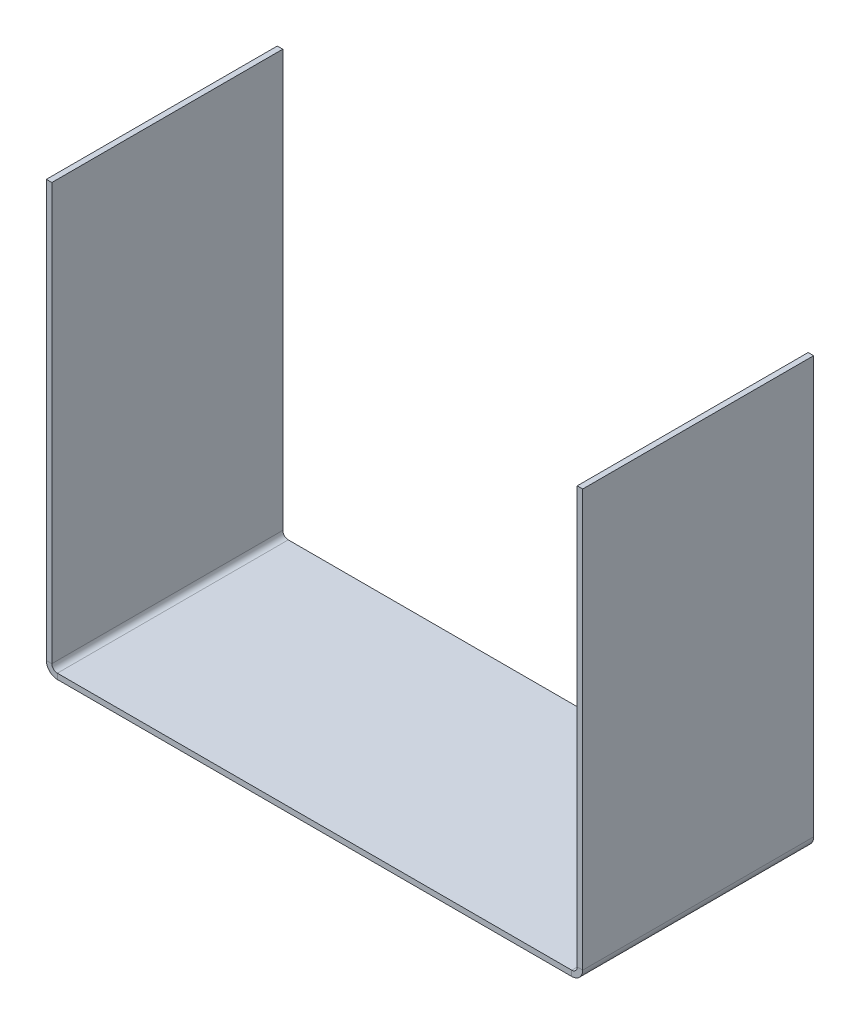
ISO-10303-21;
HEADER;
FILE_DESCRIPTION(('STEP AP214'),'2;1');
FILE_NAME('part.step','',(''),(''),'','','');
FILE_SCHEMA(('AUTOMOTIVE_DESIGN { 1 0 10303 214 1 1 1 1 }'));
ENDSEC;
DATA;
#1=APPLICATION_CONTEXT('core data for automotive mechanical design processes');
#2=APPLICATION_PROTOCOL_DEFINITION('international standard','automotive_design',2000,#1);
#3=PRODUCT_CONTEXT('',#1,'mechanical');
#4=PRODUCT('Part','Part','',(#3));
#5=PRODUCT_RELATED_PRODUCT_CATEGORY('part','',(#4));
#6=PRODUCT_DEFINITION_FORMATION('','',#4);
#7=PRODUCT_DEFINITION_CONTEXT('part definition',#1,'design');
#8=PRODUCT_DEFINITION('design','',#6,#7);
#9=PRODUCT_DEFINITION_SHAPE('','',#8);
#10=(LENGTH_UNIT() NAMED_UNIT(*) SI_UNIT(.MILLI.,.METRE.));
#11=(NAMED_UNIT(*) PLANE_ANGLE_UNIT() SI_UNIT($,.RADIAN.));
#12=(NAMED_UNIT(*) SI_UNIT($,.STERADIAN.) SOLID_ANGLE_UNIT());
#13=UNCERTAINTY_MEASURE_WITH_UNIT(LENGTH_MEASURE(1.E-05),#10,'distance_accuracy_value','');
#14=(GEOMETRIC_REPRESENTATION_CONTEXT(3) GLOBAL_UNCERTAINTY_ASSIGNED_CONTEXT((#13)) GLOBAL_UNIT_ASSIGNED_CONTEXT((#10,
#11,#12)) REPRESENTATION_CONTEXT('',''));
#15=CARTESIAN_POINT('',(0.,0.,0.));
#16=DIRECTION('',(0.,0.,1.));
#17=DIRECTION('',(1.,0.,0.));
#18=AXIS2_PLACEMENT_3D('',#15,#16,#17);
#19=CARTESIAN_POINT('',(70.5274693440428,0.,31.));
#20=DIRECTION('',(0.,0.,1.));
#21=DIRECTION('',(1.,0.,0.));
#22=AXIS2_PLACEMENT_3D('',#19,#20,#21);
#23=PLANE('',#22);
#24=DIRECTION('',(0.,1.,0.));
#25=VECTOR('',#24,1.);
#26=CARTESIAN_POINT('',(70.5274693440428,0.,31.));
#27=LINE('',#26,#25);
#28=CARTESIAN_POINT('',(70.5274693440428,0.,31.));
#29=VERTEX_POINT('',#28);
#30=CARTESIAN_POINT('',(70.5274693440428,0.7366,31.));
#31=VERTEX_POINT('',#30);
#32=EDGE_CURVE('E11',#29,#31,#27,.T.);
#33=ORIENTED_EDGE('',*,*,#32,.F.);
#34=CARTESIAN_POINT('',(70.5274693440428,1.4732,31.));
#35=DIRECTION('',(0.,0.,1.));
#36=DIRECTION('',(1.,0.,0.));
#37=AXIS2_PLACEMENT_3D('',#34,#35,#36);
#38=CIRCLE('',#37,1.4732);
#39=CARTESIAN_POINT('',(72.0006693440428,1.4732,31.));
#40=VERTEX_POINT('',#39);
#41=EDGE_CURVE('E187',#40,#29,#38,.F.);
#42=ORIENTED_EDGE('',*,*,#41,.F.);
#43=DIRECTION('',(1.,0.,0.));
#44=VECTOR('',#43,1.);
#45=CARTESIAN_POINT('',(71.2640693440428,1.4732,31.));
#46=LINE('',#45,#44);
#47=CARTESIAN_POINT('',(71.2640693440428,1.4732,31.));
#48=VERTEX_POINT('',#47);
#49=EDGE_CURVE('E40',#48,#40,#46,.T.);
#50=ORIENTED_EDGE('',*,*,#49,.F.);
#51=CARTESIAN_POINT('',(70.5274693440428,1.4732,31.));
#52=DIRECTION('',(0.,0.,1.));
#53=DIRECTION('',(1.,0.,0.));
#54=AXIS2_PLACEMENT_3D('',#51,#52,#53);
#55=CIRCLE('',#54,0.7366);
#56=EDGE_CURVE('E199',#48,#31,#55,.F.);
#57=ORIENTED_EDGE('',*,*,#56,.T.);
#58=EDGE_LOOP('',(#33,#42,#50,#57));
#59=FACE_BOUND('',#58,.T.);
#60=ADVANCED_FACE('F33',(#59),#23,.T.);
#61=CARTESIAN_POINT('',(71.2640693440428,1.4732,31.));
#62=DIRECTION('',(0.,0.,1.));
#63=DIRECTION('',(1.,0.,0.));
#64=AXIS2_PLACEMENT_3D('',#61,#62,#63);
#65=PLANE('',#64);
#66=DIRECTION('',(-1.,0.,0.));
#67=VECTOR('',#66,1.);
#68=CARTESIAN_POINT('',(0.,0.,31.));
#69=LINE('',#68,#67);
#70=CARTESIAN_POINT('',(1.4732,0.,31.));
#71=VERTEX_POINT('',#70);
#72=EDGE_CURVE('E184',#29,#71,#69,.T.);
#73=ORIENTED_EDGE('',*,*,#72,.F.);
#74=ORIENTED_EDGE('',*,*,#32,.T.);
#75=DIRECTION('',(1.,0.,0.));
#76=VECTOR('',#75,1.);
#77=CARTESIAN_POINT('',(0.,0.7366,31.));
#78=LINE('',#77,#76);
#79=CARTESIAN_POINT('',(1.4732,0.7366,31.));
#80=VERTEX_POINT('',#79);
#81=EDGE_CURVE('E202',#31,#80,#78,.F.);
#82=ORIENTED_EDGE('',*,*,#81,.T.);
#83=DIRECTION('',(0.,-1.,0.));
#84=VECTOR('',#83,1.);
#85=CARTESIAN_POINT('',(1.4732,0.7366,31.));
#86=LINE('',#85,#84);
#87=EDGE_CURVE('E54',#80,#71,#86,.T.);
#88=ORIENTED_EDGE('',*,*,#87,.T.);
#89=EDGE_LOOP('',(#73,#74,#82,#88));
#90=FACE_BOUND('',#89,.T.);
#91=ADVANCED_FACE('F276',(#90),#65,.T.);
#92=CARTESIAN_POINT('',(72.0006693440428,1.4732,0.));
#93=DIRECTION('',(0.,0.,-1.));
#94=DIRECTION('',(-1.,0.,0.));
#95=AXIS2_PLACEMENT_3D('',#92,#93,#94);
#96=PLANE('',#95);
#97=DIRECTION('',(-1.,0.,0.));
#98=VECTOR('',#97,1.);
#99=CARTESIAN_POINT('',(72.0006693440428,1.4732,0.));
#100=LINE('',#99,#98);
#101=CARTESIAN_POINT('',(72.0006693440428,1.4732,0.));
#102=VERTEX_POINT('',#101);
#103=CARTESIAN_POINT('',(71.2640693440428,1.4732,0.));
#104=VERTEX_POINT('',#103);
#105=EDGE_CURVE('E240',#102,#104,#100,.T.);
#106=ORIENTED_EDGE('',*,*,#105,.F.);
#107=CARTESIAN_POINT('',(70.5274693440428,1.4732,0.));
#108=DIRECTION('',(0.,0.,1.));
#109=DIRECTION('',(1.,0.,0.));
#110=AXIS2_PLACEMENT_3D('',#107,#108,#109);
#111=CIRCLE('',#110,1.4732);
#112=CARTESIAN_POINT('',(70.5274693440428,0.,0.));
#113=VERTEX_POINT('',#112);
#114=EDGE_CURVE('E154',#102,#113,#111,.F.);
#115=ORIENTED_EDGE('',*,*,#114,.T.);
#116=DIRECTION('',(0.,-1.,0.));
#117=VECTOR('',#116,1.);
#118=CARTESIAN_POINT('',(70.5274693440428,0.7366,0.));
#119=LINE('',#118,#117);
#120=CARTESIAN_POINT('',(70.5274693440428,0.7366,0.));
#121=VERTEX_POINT('',#120);
#122=EDGE_CURVE('E238',#121,#113,#119,.T.);
#123=ORIENTED_EDGE('',*,*,#122,.F.);
#124=CARTESIAN_POINT('',(70.5274693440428,1.4732,0.));
#125=DIRECTION('',(0.,0.,1.));
#126=DIRECTION('',(1.,0.,0.));
#127=AXIS2_PLACEMENT_3D('',#124,#125,#126);
#128=CIRCLE('',#127,0.7366);
#129=EDGE_CURVE('E166',#104,#121,#128,.F.);
#130=ORIENTED_EDGE('',*,*,#129,.F.);
#131=EDGE_LOOP('',(#106,#115,#123,#130));
#132=FACE_BOUND('',#131,.T.);
#133=ADVANCED_FACE('F284',(#132),#96,.T.);
#134=CARTESIAN_POINT('',(70.5274693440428,0.7366,0.));
#135=DIRECTION('',(0.,0.,-1.));
#136=DIRECTION('',(-1.,0.,0.));
#137=AXIS2_PLACEMENT_3D('',#134,#135,#136);
#138=PLANE('',#137);
#139=DIRECTION('',(0.,-1.,0.));
#140=VECTOR('',#139,1.);
#141=CARTESIAN_POINT('',(72.0006693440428,0.,0.));
#142=LINE('',#141,#140);
#143=CARTESIAN_POINT('',(72.0006693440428,57.4135207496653,0.));
#144=VERTEX_POINT('',#143);
#145=EDGE_CURVE('E157',#144,#102,#142,.T.);
#146=ORIENTED_EDGE('',*,*,#145,.T.);
#147=ORIENTED_EDGE('',*,*,#105,.T.);
#148=DIRECTION('',(0.,1.,0.));
#149=VECTOR('',#148,1.);
#150=CARTESIAN_POINT('',(71.2640693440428,0.,0.));
#151=LINE('',#150,#149);
#152=CARTESIAN_POINT('',(71.2640693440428,57.4135207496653,0.));
#153=VERTEX_POINT('',#152);
#154=EDGE_CURVE('E163',#153,#104,#151,.F.);
#155=ORIENTED_EDGE('',*,*,#154,.F.);
#156=DIRECTION('',(1.,0.,0.));
#157=VECTOR('',#156,1.);
#158=CARTESIAN_POINT('',(71.2640693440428,57.4135207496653,0.));
#159=LINE('',#158,#157);
#160=EDGE_CURVE('E160',#153,#144,#159,.T.);
#161=ORIENTED_EDGE('',*,*,#160,.T.);
#162=EDGE_LOOP('',(#146,#147,#155,#161));
#163=FACE_BOUND('',#162,.T.);
#164=ADVANCED_FACE('F286',(#163),#138,.T.);
#165=CARTESIAN_POINT('',(0.,1.4732,31.));
#166=DIRECTION('',(0.,0.,1.));
#167=DIRECTION('',(1.,0.,0.));
#168=AXIS2_PLACEMENT_3D('',#165,#166,#167);
#169=PLANE('',#168);
#170=DIRECTION('',(1.,0.,0.));
#171=VECTOR('',#170,1.);
#172=CARTESIAN_POINT('',(0.,1.4732,31.));
#173=LINE('',#172,#171);
#174=CARTESIAN_POINT('',(0.,1.4732,31.));
#175=VERTEX_POINT('',#174);
#176=CARTESIAN_POINT('',(0.7366,1.4732,31.));
#177=VERTEX_POINT('',#176);
#178=EDGE_CURVE('E47',#175,#177,#173,.T.);
#179=ORIENTED_EDGE('',*,*,#178,.F.);
#180=CARTESIAN_POINT('',(1.4732,1.4732,31.));
#181=DIRECTION('',(0.,0.,1.));
#182=DIRECTION('',(1.,0.,0.));
#183=AXIS2_PLACEMENT_3D('',#180,#181,#182);
#184=CIRCLE('',#183,1.4732);
#185=EDGE_CURVE('E181',#71,#175,#184,.F.);
#186=ORIENTED_EDGE('',*,*,#185,.F.);
#187=ORIENTED_EDGE('',*,*,#87,.F.);
#188=CARTESIAN_POINT('',(1.4732,1.4732,31.));
#189=DIRECTION('',(0.,0.,1.));
#190=DIRECTION('',(1.,0.,0.));
#191=AXIS2_PLACEMENT_3D('',#188,#189,#190);
#192=CIRCLE('',#191,0.7366);
#193=EDGE_CURVE('E204',#80,#177,#192,.F.);
#194=ORIENTED_EDGE('',*,*,#193,.T.);
#195=EDGE_LOOP('',(#179,#186,#187,#194));
#196=FACE_BOUND('',#195,.T.);
#197=ADVANCED_FACE('F288',(#196),#169,.T.);
#198=CARTESIAN_POINT('',(1.4732,0.7366,31.));
#199=DIRECTION('',(0.,0.,1.));
#200=DIRECTION('',(1.,0.,0.));
#201=AXIS2_PLACEMENT_3D('',#198,#199,#200);
#202=PLANE('',#201);
#203=DIRECTION('',(0.,1.,0.));
#204=VECTOR('',#203,1.);
#205=CARTESIAN_POINT('',(0.,0.,31.));
#206=LINE('',#205,#204);
#207=CARTESIAN_POINT('',(0.,57.4135207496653,31.));
#208=VERTEX_POINT('',#207);
#209=EDGE_CURVE('E178',#175,#208,#206,.T.);
#210=ORIENTED_EDGE('',*,*,#209,.F.);
#211=ORIENTED_EDGE('',*,*,#178,.T.);
#212=DIRECTION('',(0.,1.,0.));
#213=VECTOR('',#212,1.);
#214=CARTESIAN_POINT('',(0.7366,0.,31.));
#215=LINE('',#214,#213);
#216=CARTESIAN_POINT('',(0.7366,57.4135207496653,31.));
#217=VERTEX_POINT('',#216);
#218=EDGE_CURVE('E175',#177,#217,#215,.T.);
#219=ORIENTED_EDGE('',*,*,#218,.T.);
#220=DIRECTION('',(1.,0.,0.));
#221=VECTOR('',#220,1.);
#222=CARTESIAN_POINT('',(0.,57.4135207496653,31.));
#223=LINE('',#222,#221);
#224=EDGE_CURVE('E128',#208,#217,#223,.T.);
#225=ORIENTED_EDGE('',*,*,#224,.F.);
#226=EDGE_LOOP('',(#210,#211,#219,#225));
#227=FACE_BOUND('',#226,.T.);
#228=ADVANCED_FACE('F294',(#227),#202,.T.);
#229=CARTESIAN_POINT('',(1.4732,0.,0.));
#230=DIRECTION('',(0.,0.,-1.));
#231=DIRECTION('',(-1.,0.,0.));
#232=AXIS2_PLACEMENT_3D('',#229,#230,#231);
#233=PLANE('',#232);
#234=DIRECTION('',(0.,1.,0.));
#235=VECTOR('',#234,1.);
#236=CARTESIAN_POINT('',(1.4732,0.,0.));
#237=LINE('',#236,#235);
#238=CARTESIAN_POINT('',(1.4732,0.,0.));
#239=VERTEX_POINT('',#238);
#240=CARTESIAN_POINT('',(1.4732,0.7366,0.));
#241=VERTEX_POINT('',#240);
#242=EDGE_CURVE('E234',#239,#241,#237,.T.);
#243=ORIENTED_EDGE('',*,*,#242,.F.);
#244=CARTESIAN_POINT('',(1.4732,1.4732,0.));
#245=DIRECTION('',(0.,0.,1.));
#246=DIRECTION('',(1.,0.,0.));
#247=AXIS2_PLACEMENT_3D('',#244,#245,#246);
#248=CIRCLE('',#247,1.4732);
#249=CARTESIAN_POINT('',(0.,1.4732,0.));
#250=VERTEX_POINT('',#249);
#251=EDGE_CURVE('E146',#239,#250,#248,.F.);
#252=ORIENTED_EDGE('',*,*,#251,.T.);
#253=DIRECTION('',(-1.,0.,0.));
#254=VECTOR('',#253,1.);
#255=CARTESIAN_POINT('',(0.7366,1.4732,0.));
#256=LINE('',#255,#254);
#257=CARTESIAN_POINT('',(0.7366,1.4732,0.));
#258=VERTEX_POINT('',#257);
#259=EDGE_CURVE('E131',#258,#250,#256,.T.);
#260=ORIENTED_EDGE('',*,*,#259,.F.);
#261=CARTESIAN_POINT('',(1.4732,1.4732,0.));
#262=DIRECTION('',(0.,0.,1.));
#263=DIRECTION('',(1.,0.,0.));
#264=AXIS2_PLACEMENT_3D('',#261,#262,#263);
#265=CIRCLE('',#264,0.7366);
#266=EDGE_CURVE('E172',#241,#258,#265,.F.);
#267=ORIENTED_EDGE('',*,*,#266,.F.);
#268=EDGE_LOOP('',(#243,#252,#260,#267));
#269=FACE_BOUND('',#268,.T.);
#270=ADVANCED_FACE('F329',(#269),#233,.T.);
#271=CARTESIAN_POINT('',(0.7366,1.4732,0.));
#272=DIRECTION('',(0.,0.,-1.));
#273=DIRECTION('',(-1.,0.,0.));
#274=AXIS2_PLACEMENT_3D('',#271,#272,#273);
#275=PLANE('',#274);
#276=DIRECTION('',(-1.,0.,0.));
#277=VECTOR('',#276,1.);
#278=CARTESIAN_POINT('',(0.,0.,0.));
#279=LINE('',#278,#277);
#280=EDGE_CURVE('E151',#113,#239,#279,.T.);
#281=ORIENTED_EDGE('',*,*,#280,.T.);
#282=ORIENTED_EDGE('',*,*,#242,.T.);
#283=DIRECTION('',(1.,0.,0.));
#284=VECTOR('',#283,1.);
#285=CARTESIAN_POINT('',(0.,0.7366,0.));
#286=LINE('',#285,#284);
#287=EDGE_CURVE('E169',#121,#241,#286,.F.);
#288=ORIENTED_EDGE('',*,*,#287,.F.);
#289=ORIENTED_EDGE('',*,*,#122,.T.);
#290=EDGE_LOOP('',(#281,#282,#288,#289));
#291=FACE_BOUND('',#290,.T.);
#292=ADVANCED_FACE('F339',(#291),#275,.T.);
#293=CARTESIAN_POINT('',(0.7366,0.,31.));
#294=DIRECTION('',(-1.,0.,0.));
#295=DIRECTION('',(0.,0.,1.));
#296=AXIS2_PLACEMENT_3D('',#293,#294,#295);
#297=PLANE('',#296);
#298=DIRECTION('',(0.,1.,0.));
#299=VECTOR('',#298,1.);
#300=CARTESIAN_POINT('',(0.7366,0.,0.));
#301=LINE('',#300,#299);
#302=CARTESIAN_POINT('',(0.7366,57.4135207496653,0.));
#303=VERTEX_POINT('',#302);
#304=EDGE_CURVE('E136',#258,#303,#301,.T.);
#305=ORIENTED_EDGE('',*,*,#304,.T.);
#306=DIRECTION('',(0.,0.,-1.));
#307=VECTOR('',#306,1.);
#308=CARTESIAN_POINT('',(0.7366,57.4135207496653,31.));
#309=LINE('',#308,#307);
#310=EDGE_CURVE('E121',#217,#303,#309,.T.);
#311=ORIENTED_EDGE('',*,*,#310,.F.);
#312=ORIENTED_EDGE('',*,*,#218,.F.);
#313=DIRECTION('',(0.,0.,-1.));
#314=VECTOR('',#313,1.);
#315=CARTESIAN_POINT('',(0.7366,1.4732,31.));
#316=LINE('',#315,#314);
#317=EDGE_CURVE('E139',#177,#258,#316,.T.);
#318=ORIENTED_EDGE('',*,*,#317,.T.);
#319=EDGE_LOOP('',(#305,#311,#312,#318));
#320=FACE_BOUND('',#319,.T.);
#321=ADVANCED_FACE('F137',(#320),#297,.F.);
#322=CARTESIAN_POINT('',(0.,57.4135207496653,31.));
#323=DIRECTION('',(0.,1.,0.));
#324=DIRECTION('',(0.,0.,1.));
#325=AXIS2_PLACEMENT_3D('',#322,#323,#324);
#326=PLANE('',#325);
#327=DIRECTION('',(1.,0.,0.));
#328=VECTOR('',#327,1.);
#329=CARTESIAN_POINT('',(0.,57.4135207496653,0.));
#330=LINE('',#329,#328);
#331=CARTESIAN_POINT('',(0.,57.4135207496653,0.));
#332=VERTEX_POINT('',#331);
#333=EDGE_CURVE('E125',#332,#303,#330,.T.);
#334=ORIENTED_EDGE('',*,*,#333,.F.);
#335=DIRECTION('',(0.,0.,-1.));
#336=VECTOR('',#335,1.);
#337=CARTESIAN_POINT('',(0.,57.4135207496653,31.));
#338=LINE('',#337,#336);
#339=EDGE_CURVE('E132',#208,#332,#338,.T.);
#340=ORIENTED_EDGE('',*,*,#339,.F.);
#341=ORIENTED_EDGE('',*,*,#224,.T.);
#342=ORIENTED_EDGE('',*,*,#310,.T.);
#343=EDGE_LOOP('',(#334,#340,#341,#342));
#344=FACE_BOUND('',#343,.T.);
#345=ADVANCED_FACE('F123',(#344),#326,.T.);
#346=CARTESIAN_POINT('',(0.,0.,31.));
#347=DIRECTION('',(-1.,0.,0.));
#348=DIRECTION('',(0.,0.,1.));
#349=AXIS2_PLACEMENT_3D('',#346,#347,#348);
#350=PLANE('',#349);
#351=DIRECTION('',(0.,1.,0.));
#352=VECTOR('',#351,1.);
#353=CARTESIAN_POINT('',(0.,0.,0.));
#354=LINE('',#353,#352);
#355=EDGE_CURVE('E144',#250,#332,#354,.T.);
#356=ORIENTED_EDGE('',*,*,#355,.F.);
#357=DIRECTION('',(0.,0.,-1.));
#358=VECTOR('',#357,1.);
#359=CARTESIAN_POINT('',(0.,1.4732,31.));
#360=LINE('',#359,#358);
#361=EDGE_CURVE('E229',#175,#250,#360,.T.);
#362=ORIENTED_EDGE('',*,*,#361,.F.);
#363=ORIENTED_EDGE('',*,*,#209,.T.);
#364=ORIENTED_EDGE('',*,*,#339,.T.);
#365=EDGE_LOOP('',(#356,#362,#363,#364));
#366=FACE_BOUND('',#365,.T.);
#367=ADVANCED_FACE('F368',(#366),#350,.T.);
#368=CARTESIAN_POINT('',(1.4732,1.4732,31.));
#369=DIRECTION('',(0.,0.,-1.));
#370=DIRECTION('',(-1.,0.,0.));
#371=AXIS2_PLACEMENT_3D('',#368,#369,#370);
#372=CYLINDRICAL_SURFACE('',#371,1.4732);
#373=ORIENTED_EDGE('',*,*,#251,.F.);
#374=DIRECTION('',(0.,0.,-1.));
#375=VECTOR('',#374,1.);
#376=CARTESIAN_POINT('',(1.4732,0.,31.));
#377=LINE('',#376,#375);
#378=EDGE_CURVE('E226',#71,#239,#377,.T.);
#379=ORIENTED_EDGE('',*,*,#378,.F.);
#380=ORIENTED_EDGE('',*,*,#185,.T.);
#381=ORIENTED_EDGE('',*,*,#361,.T.);
#382=EDGE_LOOP('',(#373,#379,#380,#381));
#383=FACE_BOUND('',#382,.T.);
#384=ADVANCED_FACE('F378',(#383),#372,.T.);
#385=CARTESIAN_POINT('',(0.,0.,31.));
#386=DIRECTION('',(0.,-1.,0.));
#387=DIRECTION('',(0.,0.,-1.));
#388=AXIS2_PLACEMENT_3D('',#385,#386,#387);
#389=PLANE('',#388);
#390=ORIENTED_EDGE('',*,*,#280,.F.);
#391=DIRECTION('',(0.,0.,-1.));
#392=VECTOR('',#391,1.);
#393=CARTESIAN_POINT('',(70.5274693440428,0.,31.));
#394=LINE('',#393,#392);
#395=EDGE_CURVE('E223',#29,#113,#394,.T.);
#396=ORIENTED_EDGE('',*,*,#395,.F.);
#397=ORIENTED_EDGE('',*,*,#72,.T.);
#398=ORIENTED_EDGE('',*,*,#378,.T.);
#399=EDGE_LOOP('',(#390,#396,#397,#398));
#400=FACE_BOUND('',#399,.T.);
#401=ADVANCED_FACE('F280',(#400),#389,.T.);
#402=CARTESIAN_POINT('',(70.5274693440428,1.4732,31.));
#403=DIRECTION('',(0.,0.,-1.));
#404=DIRECTION('',(-1.,0.,0.));
#405=AXIS2_PLACEMENT_3D('',#402,#403,#404);
#406=CYLINDRICAL_SURFACE('',#405,1.4732);
#407=ORIENTED_EDGE('',*,*,#114,.F.);
#408=DIRECTION('',(0.,0.,-1.));
#409=VECTOR('',#408,1.);
#410=CARTESIAN_POINT('',(72.0006693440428,1.4732,31.));
#411=LINE('',#410,#409);
#412=EDGE_CURVE('E220',#40,#102,#411,.T.);
#413=ORIENTED_EDGE('',*,*,#412,.F.);
#414=ORIENTED_EDGE('',*,*,#41,.T.);
#415=ORIENTED_EDGE('',*,*,#395,.T.);
#416=EDGE_LOOP('',(#407,#413,#414,#415));
#417=FACE_BOUND('',#416,.T.);
#418=ADVANCED_FACE('F252',(#417),#406,.T.);
#419=CARTESIAN_POINT('',(72.0006693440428,0.,31.));
#420=DIRECTION('',(1.,0.,0.));
#421=DIRECTION('',(0.,0.,-1.));
#422=AXIS2_PLACEMENT_3D('',#419,#420,#421);
#423=PLANE('',#422);
#424=ORIENTED_EDGE('',*,*,#145,.F.);
#425=DIRECTION('',(0.,0.,-1.));
#426=VECTOR('',#425,1.);
#427=CARTESIAN_POINT('',(72.0006693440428,57.4135207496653,31.));
#428=LINE('',#427,#426);
#429=CARTESIAN_POINT('',(72.0006693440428,57.4135207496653,31.));
#430=VERTEX_POINT('',#429);
#431=EDGE_CURVE('E218',#430,#144,#428,.T.);
#432=ORIENTED_EDGE('',*,*,#431,.F.);
#433=DIRECTION('',(0.,-1.,0.));
#434=VECTOR('',#433,1.);
#435=CARTESIAN_POINT('',(72.0006693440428,0.,31.));
#436=LINE('',#435,#434);
#437=EDGE_CURVE('E190',#430,#40,#436,.T.);
#438=ORIENTED_EDGE('',*,*,#437,.T.);
#439=ORIENTED_EDGE('',*,*,#412,.T.);
#440=EDGE_LOOP('',(#424,#432,#438,#439));
#441=FACE_BOUND('',#440,.T.);
#442=ADVANCED_FACE('F256',(#441),#423,.T.);
#443=CARTESIAN_POINT('',(71.2640693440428,57.4135207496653,31.));
#444=DIRECTION('',(0.,1.,0.));
#445=DIRECTION('',(0.,0.,1.));
#446=AXIS2_PLACEMENT_3D('',#443,#444,#445);
#447=PLANE('',#446);
#448=ORIENTED_EDGE('',*,*,#160,.F.);
#449=DIRECTION('',(0.,0.,-1.));
#450=VECTOR('',#449,1.);
#451=CARTESIAN_POINT('',(71.2640693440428,57.4135207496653,31.));
#452=LINE('',#451,#450);
#453=CARTESIAN_POINT('',(71.2640693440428,57.4135207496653,31.));
#454=VERTEX_POINT('',#453);
#455=EDGE_CURVE('E216',#454,#153,#452,.T.);
#456=ORIENTED_EDGE('',*,*,#455,.F.);
#457=DIRECTION('',(1.,0.,0.));
#458=VECTOR('',#457,1.);
#459=CARTESIAN_POINT('',(71.2640693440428,57.4135207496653,31.));
#460=LINE('',#459,#458);
#461=EDGE_CURVE('E193',#454,#430,#460,.T.);
#462=ORIENTED_EDGE('',*,*,#461,.T.);
#463=ORIENTED_EDGE('',*,*,#431,.T.);
#464=EDGE_LOOP('',(#448,#456,#462,#463));
#465=FACE_BOUND('',#464,.T.);
#466=ADVANCED_FACE('F259',(#465),#447,.T.);
#467=CARTESIAN_POINT('',(71.2640693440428,0.,31.));
#468=DIRECTION('',(1.,0.,0.));
#469=DIRECTION('',(0.,0.,-1.));
#470=AXIS2_PLACEMENT_3D('',#467,#468,#469);
#471=PLANE('',#470);
#472=ORIENTED_EDGE('',*,*,#154,.T.);
#473=DIRECTION('',(0.,0.,-1.));
#474=VECTOR('',#473,1.);
#475=CARTESIAN_POINT('',(71.2640693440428,1.4732,31.));
#476=LINE('',#475,#474);
#477=EDGE_CURVE('E213',#48,#104,#476,.T.);
#478=ORIENTED_EDGE('',*,*,#477,.F.);
#479=DIRECTION('',(0.,1.,0.));
#480=VECTOR('',#479,1.);
#481=CARTESIAN_POINT('',(71.2640693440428,0.,31.));
#482=LINE('',#481,#480);
#483=EDGE_CURVE('E196',#454,#48,#482,.F.);
#484=ORIENTED_EDGE('',*,*,#483,.F.);
#485=ORIENTED_EDGE('',*,*,#455,.T.);
#486=EDGE_LOOP('',(#472,#478,#484,#485));
#487=FACE_BOUND('',#486,.T.);
#488=ADVANCED_FACE('F262',(#487),#471,.F.);
#489=CARTESIAN_POINT('',(70.5274693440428,1.4732,31.));
#490=DIRECTION('',(0.,0.,-1.));
#491=DIRECTION('',(-1.,0.,0.));
#492=AXIS2_PLACEMENT_3D('',#489,#490,#491);
#493=CYLINDRICAL_SURFACE('',#492,0.7366);
#494=ORIENTED_EDGE('',*,*,#129,.T.);
#495=DIRECTION('',(0.,0.,-1.));
#496=VECTOR('',#495,1.);
#497=CARTESIAN_POINT('',(70.5274693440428,0.7366,31.));
#498=LINE('',#497,#496);
#499=EDGE_CURVE('E210',#31,#121,#498,.T.);
#500=ORIENTED_EDGE('',*,*,#499,.F.);
#501=ORIENTED_EDGE('',*,*,#56,.F.);
#502=ORIENTED_EDGE('',*,*,#477,.T.);
#503=EDGE_LOOP('',(#494,#500,#501,#502));
#504=FACE_BOUND('',#503,.T.);
#505=ADVANCED_FACE('F267',(#504),#493,.F.);
#506=CARTESIAN_POINT('',(0.,0.7366,31.));
#507=DIRECTION('',(0.,-1.,0.));
#508=DIRECTION('',(0.,0.,-1.));
#509=AXIS2_PLACEMENT_3D('',#506,#507,#508);
#510=PLANE('',#509);
#511=ORIENTED_EDGE('',*,*,#287,.T.);
#512=DIRECTION('',(0.,0.,-1.));
#513=VECTOR('',#512,1.);
#514=CARTESIAN_POINT('',(1.4732,0.7366,31.));
#515=LINE('',#514,#513);
#516=EDGE_CURVE('E207',#80,#241,#515,.T.);
#517=ORIENTED_EDGE('',*,*,#516,.F.);
#518=ORIENTED_EDGE('',*,*,#81,.F.);
#519=ORIENTED_EDGE('',*,*,#499,.T.);
#520=EDGE_LOOP('',(#511,#517,#518,#519));
#521=FACE_BOUND('',#520,.T.);
#522=ADVANCED_FACE('F272',(#521),#510,.F.);
#523=CARTESIAN_POINT('',(1.4732,1.4732,31.));
#524=DIRECTION('',(0.,0.,-1.));
#525=DIRECTION('',(-1.,0.,0.));
#526=AXIS2_PLACEMENT_3D('',#523,#524,#525);
#527=CYLINDRICAL_SURFACE('',#526,0.7366);
#528=ORIENTED_EDGE('',*,*,#266,.T.);
#529=ORIENTED_EDGE('',*,*,#317,.F.);
#530=ORIENTED_EDGE('',*,*,#193,.F.);
#531=ORIENTED_EDGE('',*,*,#516,.T.);
#532=EDGE_LOOP('',(#528,#529,#530,#531));
#533=FACE_BOUND('',#532,.T.);
#534=ADVANCED_FACE('F453',(#533),#527,.F.);
#535=CARTESIAN_POINT('',(1.4732,1.4732,31.));
#536=DIRECTION('',(0.,0.,1.));
#537=DIRECTION('',(1.,0.,0.));
#538=AXIS2_PLACEMENT_3D('',#535,#536,#537);
#539=PLANE('',#538);
#540=ORIENTED_EDGE('',*,*,#483,.T.);
#541=ORIENTED_EDGE('',*,*,#49,.T.);
#542=ORIENTED_EDGE('',*,*,#437,.F.);
#543=ORIENTED_EDGE('',*,*,#461,.F.);
#544=EDGE_LOOP('',(#540,#541,#542,#543));
#545=FACE_BOUND('',#544,.T.);
#546=ADVANCED_FACE('F244',(#545),#539,.T.);
#547=CARTESIAN_POINT('',(1.4732,1.4732,0.));
#548=DIRECTION('',(0.,0.,1.));
#549=DIRECTION('',(1.,0.,0.));
#550=AXIS2_PLACEMENT_3D('',#547,#548,#549);
#551=PLANE('',#550);
#552=ORIENTED_EDGE('',*,*,#304,.F.);
#553=ORIENTED_EDGE('',*,*,#259,.T.);
#554=ORIENTED_EDGE('',*,*,#355,.T.);
#555=ORIENTED_EDGE('',*,*,#333,.T.);
#556=EDGE_LOOP('',(#552,#553,#554,#555));
#557=FACE_BOUND('',#556,.T.);
#558=ADVANCED_FACE('F142',(#557),#551,.F.);
#559=CLOSED_SHELL('',(#60,#91,#133,#164,#197,#228,#270,#292,#321,#345,#367,#384,#401,#418,#442,
#466,#488,#505,#522,#534,#546,#558));
#560=MANIFOLD_SOLID_BREP('B2',#559);
#561=ADVANCED_BREP_SHAPE_REPRESENTATION('',(#18,#560),#14);
#562=SHAPE_DEFINITION_REPRESENTATION(#9,#561);
ENDSEC;
END-ISO-10303-21;
